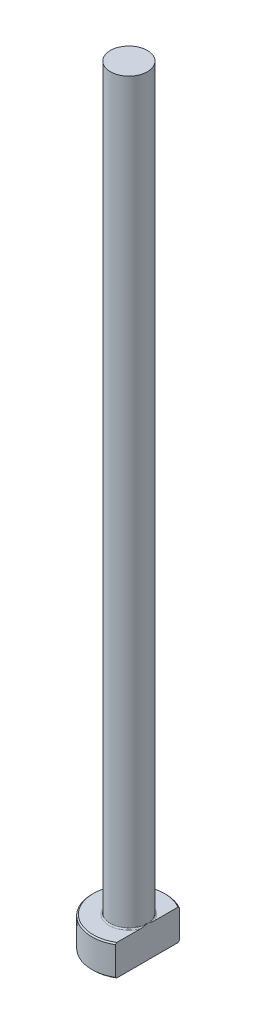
ISO-10303-21;
HEADER;
FILE_DESCRIPTION(('STEP AP214'),'2;1');
FILE_NAME('part.step','',(''),(''),'','','');
FILE_SCHEMA(('AUTOMOTIVE_DESIGN { 1 0 10303 214 1 1 1 1 }'));
ENDSEC;
DATA;
#1=APPLICATION_CONTEXT('core data for automotive mechanical design processes');
#2=APPLICATION_PROTOCOL_DEFINITION('international standard','automotive_design',2000,#1);
#3=PRODUCT_CONTEXT('',#1,'mechanical');
#4=PRODUCT('Part','Part','',(#3));
#5=PRODUCT_RELATED_PRODUCT_CATEGORY('part','',(#4));
#6=PRODUCT_DEFINITION_FORMATION('','',#4);
#7=PRODUCT_DEFINITION_CONTEXT('part definition',#1,'design');
#8=PRODUCT_DEFINITION('design','',#6,#7);
#9=PRODUCT_DEFINITION_SHAPE('','',#8);
#10=(LENGTH_UNIT() NAMED_UNIT(*) SI_UNIT(.MILLI.,.METRE.));
#11=(NAMED_UNIT(*) PLANE_ANGLE_UNIT() SI_UNIT($,.RADIAN.));
#12=(NAMED_UNIT(*) SI_UNIT($,.STERADIAN.) SOLID_ANGLE_UNIT());
#13=UNCERTAINTY_MEASURE_WITH_UNIT(LENGTH_MEASURE(1.E-05),#10,'distance_accuracy_value','');
#14=(GEOMETRIC_REPRESENTATION_CONTEXT(3) GLOBAL_UNCERTAINTY_ASSIGNED_CONTEXT((#13)) GLOBAL_UNIT_ASSIGNED_CONTEXT((#10,
#11,#12)) REPRESENTATION_CONTEXT('',''));
#15=CARTESIAN_POINT('',(0.,0.,0.));
#16=DIRECTION('',(0.,0.,1.));
#17=DIRECTION('',(1.,0.,0.));
#18=AXIS2_PLACEMENT_3D('',#15,#16,#17);
#19=CARTESIAN_POINT('',(0.,0.,0.));
#20=DIRECTION('',(0.,-1.,0.));
#21=DIRECTION('',(0.,0.,-1.));
#22=AXIS2_PLACEMENT_3D('',#19,#20,#21);
#23=PLANE('',#22);
#24=CARTESIAN_POINT('',(0.,0.,0.));
#25=DIRECTION('',(0.,-1.,0.));
#26=DIRECTION('',(0.,0.,-1.));
#27=AXIS2_PLACEMENT_3D('',#24,#25,#26);
#28=CIRCLE('',#27,5.79999999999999);
#29=CARTESIAN_POINT('',(2.99999999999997,0.,4.96386945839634));
#30=VERTEX_POINT('',#29);
#31=CARTESIAN_POINT('',(2.99999999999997,0.,-4.96386945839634));
#32=VERTEX_POINT('',#31);
#33=EDGE_CURVE('E98',#30,#32,#28,.T.);
#34=ORIENTED_EDGE('',*,*,#33,.T.);
#35=DIRECTION('',(0.,0.,1.));
#36=VECTOR('',#35,1.);
#37=CARTESIAN_POINT('',(2.99999999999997,0.,-5.19615242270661));
#38=LINE('',#37,#36);
#39=EDGE_CURVE('E83',#32,#30,#38,.T.);
#40=ORIENTED_EDGE('',*,*,#39,.T.);
#41=EDGE_LOOP('',(#34,#40));
#42=FACE_BOUND('',#41,.T.);
#43=ADVANCED_FACE('F32',(#42),#23,.T.);
#44=CARTESIAN_POINT('',(0.,259.958771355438,0.));
#45=DIRECTION('',(0.,1.,0.));
#46=DIRECTION('',(0.,0.,1.));
#47=AXIS2_PLACEMENT_3D('',#44,#45,#46);
#48=CYLINDRICAL_SURFACE('',#47,5.99999999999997);
#49=CARTESIAN_POINT('',(0.,4.79999999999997,0.));
#50=DIRECTION('',(0.,1.,0.));
#51=DIRECTION('',(0.,0.,1.));
#52=AXIS2_PLACEMENT_3D('',#49,#50,#51);
#53=CIRCLE('',#52,5.99999999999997);
#54=CARTESIAN_POINT('',(2.99999999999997,4.79999999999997,5.19615242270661));
#55=VERTEX_POINT('',#54);
#56=CARTESIAN_POINT('',(2.99999999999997,4.79999999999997,-5.19615242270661));
#57=VERTEX_POINT('',#56);
#58=EDGE_CURVE('E104',#55,#57,#53,.F.);
#59=ORIENTED_EDGE('',*,*,#58,.T.);
#60=DIRECTION('',(0.,-1.,0.));
#61=VECTOR('',#60,1.);
#62=CARTESIAN_POINT('',(2.99999999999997,125.,-5.19615242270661));
#63=LINE('',#62,#61);
#64=CARTESIAN_POINT('',(2.99999999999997,0.199999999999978,-5.19615242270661));
#65=VERTEX_POINT('',#64);
#66=EDGE_CURVE('E183',#57,#65,#63,.T.);
#67=ORIENTED_EDGE('',*,*,#66,.T.);
#68=CARTESIAN_POINT('',(0.,0.199999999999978,0.));
#69=DIRECTION('',(0.,-1.,0.));
#70=DIRECTION('',(0.,0.,-1.));
#71=AXIS2_PLACEMENT_3D('',#68,#69,#70);
#72=CIRCLE('',#71,5.99999999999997);
#73=CARTESIAN_POINT('',(2.99999999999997,0.199999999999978,5.19615242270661));
#74=VERTEX_POINT('',#73);
#75=EDGE_CURVE('E100',#65,#74,#72,.F.);
#76=ORIENTED_EDGE('',*,*,#75,.T.);
#77=DIRECTION('',(0.,-1.,0.));
#78=VECTOR('',#77,1.);
#79=CARTESIAN_POINT('',(2.99999999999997,125.,5.19615242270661));
#80=LINE('',#79,#78);
#81=EDGE_CURVE('E93',#55,#74,#80,.T.);
#82=ORIENTED_EDGE('',*,*,#81,.F.);
#83=EDGE_LOOP('',(#59,#67,#76,#82));
#84=FACE_BOUND('',#83,.T.);
#85=ADVANCED_FACE('F158',(#84),#48,.T.);
#86=CARTESIAN_POINT('',(-5.99999999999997,5.,0.));
#87=DIRECTION('',(0.,1.,0.));
#88=DIRECTION('',(0.,0.,1.));
#89=AXIS2_PLACEMENT_3D('',#86,#87,#88);
#90=PLANE('',#89);
#91=CARTESIAN_POINT('',(0.,5.,0.));
#92=DIRECTION('',(0.,1.,0.));
#93=DIRECTION('',(0.,0.,1.));
#94=AXIS2_PLACEMENT_3D('',#91,#92,#93);
#95=CIRCLE('',#94,5.79999999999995);
#96=CARTESIAN_POINT('',(2.99999999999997,5.,-4.9638694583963));
#97=VERTEX_POINT('',#96);
#98=CARTESIAN_POINT('',(2.99999999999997,5.,4.9638694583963));
#99=VERTEX_POINT('',#98);
#100=EDGE_CURVE('E178',#97,#99,#95,.T.);
#101=ORIENTED_EDGE('',*,*,#100,.T.);
#102=DIRECTION('',(0.,0.,-1.));
#103=VECTOR('',#102,1.);
#104=CARTESIAN_POINT('',(2.99999999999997,5.,0.));
#105=LINE('',#104,#103);
#106=CARTESIAN_POINT('',(2.99999999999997,4.99999999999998,1.11355287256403));
#107=VERTEX_POINT('',#106);
#108=EDGE_CURVE('E57',#99,#107,#105,.T.);
#109=ORIENTED_EDGE('',*,*,#108,.T.);
#110=CARTESIAN_POINT('',(0.,5.,0.));
#111=DIRECTION('',(0.,1.,0.));
#112=DIRECTION('',(0.,0.,1.));
#113=AXIS2_PLACEMENT_3D('',#110,#111,#112);
#114=CIRCLE('',#113,3.19999999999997);
#115=CARTESIAN_POINT('',(2.99999999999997,4.99999999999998,-1.113552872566));
#116=VERTEX_POINT('',#115);
#117=EDGE_CURVE('E107',#107,#116,#114,.F.);
#118=ORIENTED_EDGE('',*,*,#117,.T.);
#119=EDGE_CURVE('E136',#116,#97,#105,.T.);
#120=ORIENTED_EDGE('',*,*,#119,.T.);
#121=EDGE_LOOP('',(#101,#109,#118,#120));
#122=FACE_BOUND('',#121,.T.);
#123=ADVANCED_FACE('F147',(#122),#90,.T.);
#124=CARTESIAN_POINT('',(0.,5.,0.));
#125=DIRECTION('',(0.,-1.,0.));
#126=DIRECTION('',(0.,0.,-1.));
#127=AXIS2_PLACEMENT_3D('',#124,#125,#126);
#128=CONICAL_SURFACE('',#127,5.79999999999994,0.785398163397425);
#129=ORIENTED_EDGE('',*,*,#58,.F.);
#130=CARTESIAN_POINT('',(2.99999999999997,-1.01993959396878,11.432889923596));
#131=CARTESIAN_POINT('',(2.99999999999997,-0.7694249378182,11.1738796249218));
#132=CARTESIAN_POINT('',(2.99999999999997,-0.519179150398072,10.9146084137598));
#133=CARTESIAN_POINT('',(2.99999999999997,-0.0193842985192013,10.3953890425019));
#134=CARTESIAN_POINT('',(2.99999999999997,0.230164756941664,10.1354408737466));
#135=CARTESIAN_POINT('',(2.99999999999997,0.728528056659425,9.61458602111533));
#136=CARTESIAN_POINT('',(2.99999999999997,0.977341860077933,9.35367891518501));
#137=CARTESIAN_POINT('',(2.99999999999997,1.47386965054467,8.8308227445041));
#138=CARTESIAN_POINT('',(2.99999999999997,1.7215836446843,8.56887368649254));
#139=CARTESIAN_POINT('',(2.99999999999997,2.21069282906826,8.04884148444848));
#140=CARTESIAN_POINT('',(2.99999999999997,2.45211594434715,7.79078462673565));
#141=CARTESIAN_POINT('',(2.99999999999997,2.93315589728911,7.27299342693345));
#142=CARTESIAN_POINT('',(2.99999999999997,3.17277274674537,7.01325909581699));
#143=CARTESIAN_POINT('',(2.99999999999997,3.64950020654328,6.4915999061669));
#144=CARTESIAN_POINT('',(2.99999999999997,3.88661134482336,6.22967553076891));
#145=CARTESIAN_POINT('',(2.99999999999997,4.35738571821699,5.70275148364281));
#146=CARTESIAN_POINT('',(2.99999999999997,4.5910490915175,5.43775193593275));
#147=CARTESIAN_POINT('',(2.99999999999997,4.96416348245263,5.00636825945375));
#148=CARTESIAN_POINT('',(2.99999999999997,5.10520133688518,4.84135845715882));
#149=CARTESIAN_POINT('',(2.99999999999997,5.38476673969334,4.50919282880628));
#150=CARTESIAN_POINT('',(2.99999999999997,5.52329404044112,4.3420367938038));
#151=CARTESIAN_POINT('',(2.99999999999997,5.79842961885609,4.00319933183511));
#152=CARTESIAN_POINT('',(2.99999999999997,5.93500216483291,3.83148875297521));
#153=CARTESIAN_POINT('',(2.99999999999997,6.20336281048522,3.48442112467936));
#154=CARTESIAN_POINT('',(2.99999999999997,6.33515205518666,3.30906496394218));
#155=CARTESIAN_POINT('',(2.99999999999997,6.59393382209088,2.9507080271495));
#156=CARTESIAN_POINT('',(2.99999999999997,6.72082315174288,2.76763161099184));
#157=CARTESIAN_POINT('',(2.99999999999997,6.90336321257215,2.48771743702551));
#158=CARTESIAN_POINT('',(2.99999999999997,6.96295431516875,2.39345390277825));
#159=CARTESIAN_POINT('',(2.99999999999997,7.07882720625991,2.20292146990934));
#160=CARTESIAN_POINT('',(2.99999999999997,7.13510937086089,2.10665280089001));
#161=CARTESIAN_POINT('',(2.99999999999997,7.24288059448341,1.91297779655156));
#162=CARTESIAN_POINT('',(2.99999999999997,7.29441986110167,1.81559978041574));
#163=CARTESIAN_POINT('',(2.99999999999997,7.39241237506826,1.61833215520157));
#164=CARTESIAN_POINT('',(2.99999999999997,7.43886469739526,1.51844209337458));
#165=CARTESIAN_POINT('',(2.99999999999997,7.56840030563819,1.21511948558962));
#166=CARTESIAN_POINT('',(2.99999999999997,7.64209011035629,1.00730397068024));
#167=CARTESIAN_POINT('',(2.99999999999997,7.72186700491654,0.695731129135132));
#168=CARTESIAN_POINT('',(2.99999999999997,7.74302901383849,0.595791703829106));
#169=CARTESIAN_POINT('',(2.99999999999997,7.77582528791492,0.394325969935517));
#170=CARTESIAN_POINT('',(2.99999999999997,7.78746040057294,0.29279980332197));
#171=CARTESIAN_POINT('',(2.99999999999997,7.80037895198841,0.0893987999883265));
#172=CARTESIAN_POINT('',(2.99999999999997,7.80169449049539,-0.0124739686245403));
#173=CARTESIAN_POINT('',(2.99999999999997,7.79396363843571,-0.215826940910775));
#174=CARTESIAN_POINT('',(2.99999999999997,7.78491639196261,-0.317307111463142));
#175=CARTESIAN_POINT('',(2.99999999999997,7.75721241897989,-0.518039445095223));
#176=CARTESIAN_POINT('',(2.99999999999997,7.73863812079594,-0.61730321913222));
#177=CARTESIAN_POINT('',(2.99999999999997,7.69303955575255,-0.813850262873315));
#178=CARTESIAN_POINT('',(2.99999999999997,7.66601427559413,-0.911133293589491));
#179=CARTESIAN_POINT('',(2.99999999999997,7.60464499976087,-1.10394843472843));
#180=CARTESIAN_POINT('',(2.99999999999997,7.57025976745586,-1.19946724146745));
#181=CARTESIAN_POINT('',(2.99999999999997,7.49555762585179,-1.38810736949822));
#182=CARTESIAN_POINT('',(2.99999999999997,7.45524192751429,-1.48122917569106));
#183=CARTESIAN_POINT('',(2.99999999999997,7.36961028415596,-1.66561491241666));
#184=CARTESIAN_POINT('',(2.99999999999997,7.32427350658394,-1.75686908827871));
#185=CARTESIAN_POINT('',(2.99999999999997,7.22966073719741,-1.93732130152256));
#186=CARTESIAN_POINT('',(2.99999999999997,7.18038388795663,-2.02651888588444));
#187=CARTESIAN_POINT('',(2.99999999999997,7.02771106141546,-2.29153460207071));
#188=CARTESIAN_POINT('',(2.99999999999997,6.91955486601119,-2.46460625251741));
#189=CARTESIAN_POINT('',(2.99999999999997,6.69440299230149,-2.80577028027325));
#190=CARTESIAN_POINT('',(2.99999999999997,6.57737415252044,-2.97384034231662));
#191=CARTESIAN_POINT('',(2.99999999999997,6.33748949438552,-3.30561771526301));
#192=CARTESIAN_POINT('',(2.99999999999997,6.2146366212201,-3.46932716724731));
#193=CARTESIAN_POINT('',(2.99999999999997,5.96308085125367,-3.79561670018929));
#194=CARTESIAN_POINT('',(2.99999999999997,5.83432224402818,-3.95815356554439));
#195=CARTESIAN_POINT('',(2.99999999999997,5.57361365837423,-4.28066737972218));
#196=CARTESIAN_POINT('',(2.99999999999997,5.44166333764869,-4.44064405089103));
#197=CARTESIAN_POINT('',(2.99999999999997,5.1756844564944,-4.75819552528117));
#198=CARTESIAN_POINT('',(2.99999999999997,5.04166171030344,-4.91577521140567));
#199=CARTESIAN_POINT('',(2.99999999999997,4.77176230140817,-5.22934053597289));
#200=CARTESIAN_POINT('',(2.99999999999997,4.63588560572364,-5.38532614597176));
#201=CARTESIAN_POINT('',(2.99999999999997,4.27256222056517,-5.79849838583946));
#202=CARTESIAN_POINT('',(2.99999999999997,4.04384014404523,-6.05456265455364));
#203=CARTESIAN_POINT('',(2.99999999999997,3.5836002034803,-6.56417037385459));
#204=CARTESIAN_POINT('',(2.99999999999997,3.35208226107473,-6.81771375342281));
#205=CARTESIAN_POINT('',(2.99999999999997,2.88678846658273,-7.32315936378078));
#206=CARTESIAN_POINT('',(2.99999999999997,2.65301069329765,-7.5750598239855));
#207=CARTESIAN_POINT('',(2.99999999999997,2.18392232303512,-8.07742926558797));
#208=CARTESIAN_POINT('',(2.99999999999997,1.94861172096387,-8.32789824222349));
#209=CARTESIAN_POINT('',(2.99999999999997,1.48651581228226,-8.8174394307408));
#210=CARTESIAN_POINT('',(2.99999999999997,1.25977806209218,-9.05655656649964));
#211=CARTESIAN_POINT('',(2.99999999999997,0.805439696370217,-9.533971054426));
#212=CARTESIAN_POINT('',(2.99999999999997,0.57783907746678,-9.77226840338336));
#213=CARTESIAN_POINT('',(2.99999999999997,0.122198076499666,-10.2479325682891));
#214=CARTESIAN_POINT('',(2.99999999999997,-0.105841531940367,-10.4853001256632));
#215=CARTESIAN_POINT('',(2.99999999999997,-0.562491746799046,-10.9594816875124));
#216=CARTESIAN_POINT('',(2.99999999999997,-0.791102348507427,-11.1962956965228));
#217=CARTESIAN_POINT('',(2.99999999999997,-1.01993959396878,-11.432889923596));
#218=B_SPLINE_CURVE_WITH_KNOTS('',3,(#130,#131,#132,#133,#134,#135,#136,#137,#138,#139,#140,
#141,#142,#143,#144,#145,#146,#147,#148,#149,#150,#151,#152,#153,#154,#155,#156,#157,#158,#159,
#160,#161,#162,#163,#164,#165,#166,#167,#168,#169,#170,#171,#172,#173,#174,#175,#176,#177,#178,
#179,#180,#181,#182,#183,#184,#185,#186,#187,#188,#189,#190,#191,#192,#193,#194,#195,#196,#197,
#198,#199,#200,#201,#202,#203,#204,#205,#206,#207,#208,#209,#210,#211,#212,#213,#214,#215,#216,
#217),.UNSPECIFIED.,.F.,.F.,(4,2,2,2,2,2,2,2,2,2,2,2,2,2,2,2,2,2,2,2,2,2,2,2,2,2,2,2,2,2,2,2,2,
2,2,2,2,2,2,2,2,2,2,4),(0.,1.0810166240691,2.16204714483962,3.24363027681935,4.32520642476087,
5.38534462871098,6.44547590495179,7.50537917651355,8.56523985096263,9.21643479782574,
9.8676936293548,10.5258323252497,11.1838124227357,11.8517813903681,12.1862877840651,
12.520756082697,12.8511332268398,13.1815703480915,13.8399161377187,14.1460077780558,
14.4520721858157,14.7571841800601,15.0623213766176,15.364861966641,15.6674388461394,
15.9717575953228,16.2760142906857,16.581584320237,16.8872210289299,17.4990577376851,
18.1133060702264,18.7272470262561,19.3492675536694,19.9713550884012,20.5919343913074,
21.2125247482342,22.2425132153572,23.2725306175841,24.3035181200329,25.3345090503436,
26.32308273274,27.3116602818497,28.2991352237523,29.2866020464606),.UNSPECIFIED.);
#219=EDGE_CURVE('E135',#55,#99,#218,.T.);
#220=ORIENTED_EDGE('',*,*,#219,.T.);
#221=ORIENTED_EDGE('',*,*,#100,.F.);
#222=EDGE_CURVE('E127',#97,#57,#218,.T.);
#223=ORIENTED_EDGE('',*,*,#222,.T.);
#224=EDGE_LOOP('',(#129,#220,#221,#223));
#225=FACE_BOUND('',#224,.T.);
#226=ADVANCED_FACE('F143',(#225),#128,.T.);
#227=CARTESIAN_POINT('',(0.,0.199999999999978,0.));
#228=DIRECTION('',(0.,1.,0.));
#229=DIRECTION('',(0.,0.,1.));
#230=AXIS2_PLACEMENT_3D('',#227,#228,#229);
#231=CONICAL_SURFACE('',#230,5.99999999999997,0.785398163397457);
#232=ORIENTED_EDGE('',*,*,#75,.F.);
#233=CARTESIAN_POINT('',(2.99999999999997,6.01993959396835,-11.432889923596));
#234=CARTESIAN_POINT('',(2.99999999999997,5.7694249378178,-11.1738796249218));
#235=CARTESIAN_POINT('',(2.99999999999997,5.5191791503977,-10.9146084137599));
#236=CARTESIAN_POINT('',(2.99999999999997,5.01938429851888,-10.395389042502));
#237=CARTESIAN_POINT('',(2.99999999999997,4.76983524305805,-10.1354408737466));
#238=CARTESIAN_POINT('',(2.99999999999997,4.27147194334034,-9.61458602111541));
#239=CARTESIAN_POINT('',(2.99999999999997,4.02265813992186,-9.35367891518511));
#240=CARTESIAN_POINT('',(2.99999999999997,3.52613034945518,-8.83082274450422));
#241=CARTESIAN_POINT('',(2.99999999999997,3.27841635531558,-8.56887368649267));
#242=CARTESIAN_POINT('',(2.99999999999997,2.78930717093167,-8.04884148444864));
#243=CARTESIAN_POINT('',(2.99999999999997,2.5478840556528,-7.79078462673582));
#244=CARTESIAN_POINT('',(2.99999999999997,2.0668441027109,-7.27299342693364));
#245=CARTESIAN_POINT('',(2.99999999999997,1.82722725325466,-7.0132590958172));
#246=CARTESIAN_POINT('',(2.99999999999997,1.3504997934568,-6.49159990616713));
#247=CARTESIAN_POINT('',(2.99999999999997,1.11338865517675,-6.22967553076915));
#248=CARTESIAN_POINT('',(2.99999999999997,0.642614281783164,-5.70275148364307));
#249=CARTESIAN_POINT('',(2.99999999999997,0.408950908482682,-5.43775193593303));
#250=CARTESIAN_POINT('',(2.99999999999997,0.0358365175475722,-5.00636825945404));
#251=CARTESIAN_POINT('',(2.99999999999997,-0.105201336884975,-4.8413584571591));
#252=CARTESIAN_POINT('',(2.99999999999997,-0.384766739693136,-4.50919282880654));
#253=CARTESIAN_POINT('',(2.99999999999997,-0.523294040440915,-4.34203679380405));
#254=CARTESIAN_POINT('',(2.99999999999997,-0.798429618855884,-4.00319933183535));
#255=CARTESIAN_POINT('',(2.99999999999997,-0.93500216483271,-3.83148875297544));
#256=CARTESIAN_POINT('',(2.99999999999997,-1.20336281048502,-3.48442112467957));
#257=CARTESIAN_POINT('',(2.99999999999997,-1.33515205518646,-3.30906496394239));
#258=CARTESIAN_POINT('',(2.99999999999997,-1.59393382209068,-2.9507080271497));
#259=CARTESIAN_POINT('',(2.99999999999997,-1.72082315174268,-2.76763161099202));
#260=CARTESIAN_POINT('',(2.99999999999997,-1.90336321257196,-2.48771743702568));
#261=CARTESIAN_POINT('',(2.99999999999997,-1.96295431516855,-2.39345390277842));
#262=CARTESIAN_POINT('',(2.99999999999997,-2.07882720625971,-2.20292146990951));
#263=CARTESIAN_POINT('',(2.99999999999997,-2.13510937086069,-2.10665280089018));
#264=CARTESIAN_POINT('',(2.99999999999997,-2.24288059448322,-1.91297779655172));
#265=CARTESIAN_POINT('',(2.99999999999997,-2.29441986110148,-1.8155997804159));
#266=CARTESIAN_POINT('',(2.99999999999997,-2.39241237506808,-1.61833215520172));
#267=CARTESIAN_POINT('',(2.99999999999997,-2.43886469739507,-1.51844209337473));
#268=CARTESIAN_POINT('',(2.99999999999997,-2.56840030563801,-1.21511948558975));
#269=CARTESIAN_POINT('',(2.99999999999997,-2.64209011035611,-1.00730397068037));
#270=CARTESIAN_POINT('',(2.99999999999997,-2.72186700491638,-0.695731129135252));
#271=CARTESIAN_POINT('',(2.99999999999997,-2.74302901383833,-0.595791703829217));
#272=CARTESIAN_POINT('',(2.99999999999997,-2.77582528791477,-0.394325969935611));
#273=CARTESIAN_POINT('',(2.99999999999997,-2.78746040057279,-0.292799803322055));
#274=CARTESIAN_POINT('',(2.99999999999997,-2.80037895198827,-0.0893987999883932));
#275=CARTESIAN_POINT('',(2.99999999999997,-2.80169449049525,0.0124739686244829));
#276=CARTESIAN_POINT('',(2.99999999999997,-2.79396363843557,0.215826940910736));
#277=CARTESIAN_POINT('',(2.99999999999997,-2.78491639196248,0.317307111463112));
#278=CARTESIAN_POINT('',(2.99999999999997,-2.75721241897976,0.518039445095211));
#279=CARTESIAN_POINT('',(2.99999999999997,-2.7386381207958,0.617303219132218));
#280=CARTESIAN_POINT('',(2.99999999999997,-2.69303955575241,0.813850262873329));
#281=CARTESIAN_POINT('',(2.99999999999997,-2.66601427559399,0.911133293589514));
#282=CARTESIAN_POINT('',(2.99999999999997,-2.60464499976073,1.10394843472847));
#283=CARTESIAN_POINT('',(2.99999999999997,-2.57025976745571,1.1994672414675));
#284=CARTESIAN_POINT('',(2.99999999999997,-2.49555762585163,1.38810736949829));
#285=CARTESIAN_POINT('',(2.99999999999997,-2.45524192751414,1.48122917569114));
#286=CARTESIAN_POINT('',(2.99999999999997,-2.36961028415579,1.66561491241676));
#287=CARTESIAN_POINT('',(2.99999999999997,-2.32427350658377,1.75686908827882));
#288=CARTESIAN_POINT('',(2.99999999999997,-2.22966073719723,1.9373213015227));
#289=CARTESIAN_POINT('',(2.99999999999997,-2.18038388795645,2.02651888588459));
#290=CARTESIAN_POINT('',(2.99999999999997,-2.02771106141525,2.29153460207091));
#291=CARTESIAN_POINT('',(2.99999999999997,-1.91955486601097,2.46460625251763));
#292=CARTESIAN_POINT('',(2.99999999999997,-1.69440299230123,2.80577028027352));
#293=CARTESIAN_POINT('',(2.99999999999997,-1.57737415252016,2.97384034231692));
#294=CARTESIAN_POINT('',(2.99999999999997,-1.33748949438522,3.30561771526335));
#295=CARTESIAN_POINT('',(2.99999999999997,-1.21463662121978,3.46932716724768));
#296=CARTESIAN_POINT('',(2.99999999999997,-0.963080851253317,3.79561670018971));
#297=CARTESIAN_POINT('',(2.99999999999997,-0.834322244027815,3.95815356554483));
#298=CARTESIAN_POINT('',(2.99999999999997,-0.573613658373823,4.28066737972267));
#299=CARTESIAN_POINT('',(2.99999999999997,-0.441663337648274,4.44064405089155));
#300=CARTESIAN_POINT('',(2.99999999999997,-0.17568445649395,4.75819552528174));
#301=CARTESIAN_POINT('',(2.99999999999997,-0.0416617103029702,4.91577521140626));
#302=CARTESIAN_POINT('',(2.99999999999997,0.228237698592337,5.22934053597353));
#303=CARTESIAN_POINT('',(2.99999999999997,0.364114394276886,5.38532614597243));
#304=CARTESIAN_POINT('',(2.99999999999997,0.727437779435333,5.79849838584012));
#305=CARTESIAN_POINT('',(2.99999999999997,0.956159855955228,6.05456265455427));
#306=CARTESIAN_POINT('',(2.99999999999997,1.41639979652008,6.56417037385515));
#307=CARTESIAN_POINT('',(2.99999999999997,1.64791773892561,6.81771375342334));
#308=CARTESIAN_POINT('',(2.99999999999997,2.11321153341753,7.32315936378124));
#309=CARTESIAN_POINT('',(2.99999999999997,2.34698930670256,7.57505982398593));
#310=CARTESIAN_POINT('',(2.99999999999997,2.816077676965,8.07742926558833));
#311=CARTESIAN_POINT('',(2.99999999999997,3.05138827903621,8.32789824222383));
#312=CARTESIAN_POINT('',(2.99999999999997,3.51348418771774,8.81743943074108));
#313=CARTESIAN_POINT('',(2.99999999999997,3.74022193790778,9.05655656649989));
#314=CARTESIAN_POINT('',(2.99999999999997,4.19456030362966,9.5339710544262));
#315=CARTESIAN_POINT('',(2.99999999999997,4.42216092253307,9.77226840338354));
#316=CARTESIAN_POINT('',(2.99999999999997,4.8778019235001,10.2479325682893));
#317=CARTESIAN_POINT('',(2.99999999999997,5.1058415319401,10.4853001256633));
#318=CARTESIAN_POINT('',(2.99999999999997,5.5624917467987,10.9594816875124));
#319=CARTESIAN_POINT('',(2.99999999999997,5.79110234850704,11.1962956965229));
#320=CARTESIAN_POINT('',(2.99999999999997,6.01993959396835,11.432889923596));
#321=B_SPLINE_CURVE_WITH_KNOTS('',3,(#233,#234,#235,#236,#237,#238,#239,#240,#241,#242,#243,
#244,#245,#246,#247,#248,#249,#250,#251,#252,#253,#254,#255,#256,#257,#258,#259,#260,#261,#262,
#263,#264,#265,#266,#267,#268,#269,#270,#271,#272,#273,#274,#275,#276,#277,#278,#279,#280,#281,
#282,#283,#284,#285,#286,#287,#288,#289,#290,#291,#292,#293,#294,#295,#296,#297,#298,#299,#300,
#301,#302,#303,#304,#305,#306,#307,#308,#309,#310,#311,#312,#313,#314,#315,#316,#317,#318,#319,
#320),.UNSPECIFIED.,.F.,.F.,(4,2,2,2,2,2,2,2,2,2,2,2,2,2,2,2,2,2,2,2,2,2,2,2,2,2,2,2,2,2,2,2,2,
2,2,2,2,2,2,2,2,2,2,4),(0.,1.08101662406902,2.16204714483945,3.2436302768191,4.32520642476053,
5.38534462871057,6.4454759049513,7.50537917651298,8.56523985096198,9.21643479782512,
9.8676936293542,10.5258323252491,11.1838124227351,11.8517813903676,12.1862877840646,
12.5207560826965,12.8511332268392,13.181570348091,13.8399161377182,14.1460077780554,
14.4520721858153,14.7571841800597,15.0623213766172,15.3648619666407,15.667438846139,
15.9717575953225,16.2760142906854,16.5815843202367,16.8872210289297,17.499057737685,
18.1133060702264,18.7272470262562,19.3492675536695,19.9713550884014,20.5919343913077,
21.2125247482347,22.2425132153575,23.2725306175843,24.3035181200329,25.3345090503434,
26.3230827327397,27.3116602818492,28.2991352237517,29.2866020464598),.UNSPECIFIED.);
#322=EDGE_CURVE('E86',#65,#32,#321,.T.);
#323=ORIENTED_EDGE('',*,*,#322,.T.);
#324=ORIENTED_EDGE('',*,*,#33,.F.);
#325=EDGE_CURVE('E89',#30,#74,#321,.T.);
#326=ORIENTED_EDGE('',*,*,#325,.T.);
#327=EDGE_LOOP('',(#232,#323,#324,#326));
#328=FACE_BOUND('',#327,.T.);
#329=ADVANCED_FACE('F97',(#328),#231,.T.);
#330=CARTESIAN_POINT('',(0.,5.19999999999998,0.));
#331=DIRECTION('',(0.,1.,0.));
#332=DIRECTION('',(0.,0.,1.));
#333=AXIS2_PLACEMENT_3D('',#330,#331,#332);
#334=TOROIDAL_SURFACE('',#333,3.19999999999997,0.2);
#335=CARTESIAN_POINT('',(2.99999999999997,5.19999999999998,0.));
#336=CARTESIAN_POINT('',(2.99999999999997,5.20000054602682,-8.25589702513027E-09));
#337=CARTESIAN_POINT('',(2.99999999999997,5.20000108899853,-2.22623702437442E-07));
#338=CARTESIAN_POINT('',(2.99999999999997,5.20000210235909,-8.13181300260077E-07));
#339=CARTESIAN_POINT('',(2.99999999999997,5.20000256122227,-1.20262206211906E-06));
#340=CARTESIAN_POINT('',(2.99999999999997,5.20000351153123,-2.13233189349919E-06));
#341=CARTESIAN_POINT('',(2.99999999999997,5.2000039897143,-2.68711073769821E-06));
#342=CARTESIAN_POINT('',(2.99999999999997,5.20000484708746,-3.83722986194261E-06));
#343=CARTESIAN_POINT('',(2.99999999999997,5.20000522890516,-4.43075968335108E-06));
#344=CARTESIAN_POINT('',(2.99999999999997,5.20000663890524,-6.71805399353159E-06));
#345=CARTESIAN_POINT('',(2.99999999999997,5.20000758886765,-8.46267320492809E-06));
#346=CARTESIAN_POINT('',(2.99999999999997,5.20000915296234,-1.19195937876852E-05));
#347=CARTESIAN_POINT('',(2.99999999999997,5.20000978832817,-1.36226966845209E-05));
#348=CARTESIAN_POINT('',(2.99999999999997,5.20001243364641,-2.07785327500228E-05));
#349=CARTESIAN_POINT('',(2.99999999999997,5.20001439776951,-2.62512686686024E-05));
#350=CARTESIAN_POINT('',(2.99999999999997,5.20001730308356,-3.65971251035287E-05));
#351=CARTESIAN_POINT('',(2.99999999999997,5.20001835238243,-4.14397201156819E-05));
#352=CARTESIAN_POINT('',(2.99999999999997,5.20002589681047,-7.68826107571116E-05));
#353=CARTESIAN_POINT('',(2.99999999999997,5.20003169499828,-0.000107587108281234));
#354=CARTESIAN_POINT('',(2.99999999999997,5.20005649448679,-0.000225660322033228));
#355=CARTESIAN_POINT('',(2.99999999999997,5.2000799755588,-0.000312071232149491));
#356=CARTESIAN_POINT('',(2.99999999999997,5.2001671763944,-0.000638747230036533));
#357=CARTESIAN_POINT('',(2.99999999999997,5.20022823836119,-0.000879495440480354));
#358=CARTESIAN_POINT('',(2.99999999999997,5.20046253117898,-0.00179757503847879));
#359=CARTESIAN_POINT('',(2.99999999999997,5.20063826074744,-0.00247448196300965));
#360=CARTESIAN_POINT('',(2.99999999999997,5.20145771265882,-0.00563611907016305));
#361=CARTESIAN_POINT('',(2.99999999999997,5.20209802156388,-0.00812138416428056));
#362=CARTESIAN_POINT('',(2.99999999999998,5.207470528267,-0.0289666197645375));
#363=CARTESIAN_POINT('',(2.99999999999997,5.2122144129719,-0.0473249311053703));
#364=CARTESIAN_POINT('',(2.99999999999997,5.2215041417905,-0.0833908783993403));
#365=CARTESIAN_POINT('',(2.99999999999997,5.22605099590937,-0.101098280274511));
#366=CARTESIAN_POINT('',(2.99999999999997,5.24071513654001,-0.158441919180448));
#367=CARTESIAN_POINT('',(2.99999999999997,5.25076238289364,-0.198096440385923));
#368=CARTESIAN_POINT('',(2.99999999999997,5.26735876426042,-0.264903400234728));
#369=CARTESIAN_POINT('',(2.99999999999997,5.27400650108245,-0.292031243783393));
#370=CARTESIAN_POINT('',(2.99999999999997,5.28691139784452,-0.345693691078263));
#371=CARTESIAN_POINT('',(2.99999999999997,5.29317409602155,-0.372226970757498));
#372=CARTESIAN_POINT('',(2.99999999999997,5.31359314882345,-0.460847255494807));
#373=CARTESIAN_POINT('',(2.99999999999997,5.3271194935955,-0.52308420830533));
#374=CARTESIAN_POINT('',(2.99999999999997,5.35185224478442,-0.648627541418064));
#375=CARTESIAN_POINT('',(2.99999999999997,5.36303576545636,-0.711938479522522));
#376=CARTESIAN_POINT('',(2.99999999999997,5.382697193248,-0.845442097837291));
#377=CARTESIAN_POINT('',(2.99999999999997,5.39079783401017,-0.915695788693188));
#378=CARTESIAN_POINT('',(2.99999999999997,5.39788104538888,-1.02128246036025));
#379=CARTESIAN_POINT('',(2.99999999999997,5.399399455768,-1.05644278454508));
#380=CARTESIAN_POINT('',(2.99999999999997,5.40031405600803,-1.12678521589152));
#381=CARTESIAN_POINT('',(2.99999999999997,5.39971158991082,-1.16196729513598));
#382=CARTESIAN_POINT('',(2.99999999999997,5.39660553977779,-1.21713951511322));
#383=CARTESIAN_POINT('',(2.99999999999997,5.39502683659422,-1.23718181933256));
#384=CARTESIAN_POINT('',(2.99999999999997,5.39080008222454,-1.27717351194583));
#385=CARTESIAN_POINT('',(2.99999999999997,5.38815120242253,-1.29712281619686));
#386=CARTESIAN_POINT('',(2.99999999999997,5.38160570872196,-1.33655702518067));
#387=CARTESIAN_POINT('',(2.99999999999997,5.37772556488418,-1.35604460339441));
#388=CARTESIAN_POINT('',(2.99999999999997,5.36841119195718,-1.39463554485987));
#389=CARTESIAN_POINT('',(2.99999999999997,5.36297874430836,-1.41373932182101));
#390=CARTESIAN_POINT('',(2.99999999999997,5.3500393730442,-1.45151809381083));
#391=CARTESIAN_POINT('',(2.99999999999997,5.34250654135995,-1.47018435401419));
#392=CARTESIAN_POINT('',(2.99999999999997,5.32469433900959,-1.50617232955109));
#393=CARTESIAN_POINT('',(2.99999999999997,5.31442814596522,-1.52349999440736));
#394=CARTESIAN_POINT('',(2.99999999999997,5.29768486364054,-1.5453003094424));
#395=CARTESIAN_POINT('',(2.99999999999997,5.29285641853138,-1.551032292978));
#396=CARTESIAN_POINT('',(2.99999999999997,5.28257691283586,-1.56192749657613));
#397=CARTESIAN_POINT('',(2.99999999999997,5.27712536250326,-1.56709026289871));
#398=CARTESIAN_POINT('',(2.99999999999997,5.26548354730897,-1.57666725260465));
#399=CARTESIAN_POINT('',(2.99999999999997,5.25928560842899,-1.58107232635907));
#400=CARTESIAN_POINT('',(2.99999999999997,5.24620912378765,-1.5887219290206));
#401=CARTESIAN_POINT('',(2.99999999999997,5.23933242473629,-1.59196950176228));
#402=CARTESIAN_POINT('',(2.99999999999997,5.22702406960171,-1.5962468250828));
#403=CARTESIAN_POINT('',(2.99999999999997,5.2217197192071,-1.59764171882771));
#404=CARTESIAN_POINT('',(2.99999999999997,5.2109516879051,-1.59951721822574));
#405=CARTESIAN_POINT('',(2.99999999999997,5.20548813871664,-1.59999855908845));
#406=CARTESIAN_POINT('',(2.99999999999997,5.19455397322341,-1.60000143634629));
#407=CARTESIAN_POINT('',(2.99999999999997,5.18908335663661,-1.59952177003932));
#408=CARTESIAN_POINT('',(2.99999999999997,5.17830149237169,-1.59764696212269));
#409=CARTESIAN_POINT('',(2.99999999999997,5.17299036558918,-1.59625114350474));
#410=CARTESIAN_POINT('',(2.99999999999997,5.16137413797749,-1.5922159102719));
#411=CARTESIAN_POINT('',(2.99999999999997,5.15514663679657,-1.58935479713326));
#412=CARTESIAN_POINT('',(2.99999999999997,5.14323789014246,-1.58266473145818));
#413=CARTESIAN_POINT('',(2.99999999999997,5.13755768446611,-1.57883398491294));
#414=CARTESIAN_POINT('',(2.99999999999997,5.12388989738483,-1.5682309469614));
#415=CARTESIAN_POINT('',(2.99999999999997,5.11627920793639,-1.56097697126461));
#416=CARTESIAN_POINT('',(2.99999999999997,5.10222993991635,-1.54541986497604));
#417=CARTESIAN_POINT('',(2.99999999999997,5.09579438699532,-1.53711411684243));
#418=CARTESIAN_POINT('',(2.99999999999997,5.07874447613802,-1.51234359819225));
#419=CARTESIAN_POINT('',(2.99999999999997,5.06934681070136,-1.49505024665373));
#420=CARTESIAN_POINT('',(2.99999999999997,5.05300413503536,-1.45936637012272));
#421=CARTESIAN_POINT('',(2.99999999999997,5.04606563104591,-1.440973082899));
#422=CARTESIAN_POINT('',(2.99999999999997,5.03343712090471,-1.40170303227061));
#423=CARTESIAN_POINT('',(2.99999999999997,5.02794514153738,-1.38076360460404));
#424=CARTESIAN_POINT('',(2.99999999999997,5.01869119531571,-1.33849708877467));
#425=CARTESIAN_POINT('',(2.99999999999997,5.01493126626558,-1.31716957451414));
#426=CARTESIAN_POINT('',(2.99999999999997,5.00879575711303,-1.27427301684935));
#427=CARTESIAN_POINT('',(2.99999999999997,5.00642327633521,-1.25270354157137));
#428=CARTESIAN_POINT('',(2.99999999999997,5.00283272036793,-1.20948719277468));
#429=CARTESIAN_POINT('',(2.99999999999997,5.00161392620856,-1.18784037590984));
#430=CARTESIAN_POINT('',(2.99999999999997,4.99921193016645,-1.11739576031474));
#431=CARTESIAN_POINT('',(2.99999999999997,4.99998309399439,-1.06853061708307));
#432=CARTESIAN_POINT('',(2.99999999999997,5.00498456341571,-0.970964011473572));
#433=CARTESIAN_POINT('',(2.99999999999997,5.00921876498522,-0.922262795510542));
#434=CARTESIAN_POINT('',(2.99999999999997,5.02027934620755,-0.825023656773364));
#435=CARTESIAN_POINT('',(2.99999999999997,5.02711306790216,-0.776486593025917));
#436=CARTESIAN_POINT('',(2.99999999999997,5.04272509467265,-0.679720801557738));
#437=CARTESIAN_POINT('',(2.99999999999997,5.05150395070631,-0.631492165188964));
#438=CARTESIAN_POINT('',(2.99999999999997,5.07999589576,-0.487173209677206));
#439=CARTESIAN_POINT('',(2.99999999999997,5.10185558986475,-0.391514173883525));
#440=CARTESIAN_POINT('',(2.99999999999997,5.14819769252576,-0.200831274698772));
#441=CARTESIAN_POINT('',(2.99999999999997,5.17268119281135,-0.105807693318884));
#442=CARTESIAN_POINT('',(2.99999999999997,5.19722910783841,-0.0107318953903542));
#443=CARTESIAN_POINT('',(2.99999999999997,5.19724528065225,-0.0106692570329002));
#444=CARTESIAN_POINT('',(2.99999999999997,5.19781243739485,-0.00847232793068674));
#445=CARTESIAN_POINT('',(2.99999999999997,5.19836102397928,-0.00633759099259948));
#446=CARTESIAN_POINT('',(2.99999999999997,5.1991597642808,-0.00325873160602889));
#447=CARTESIAN_POINT('',(2.99999999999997,5.19940591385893,-0.00231386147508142));
#448=CARTESIAN_POINT('',(2.99999999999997,5.19972567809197,-0.00105818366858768));
#449=CARTESIAN_POINT('',(2.99999999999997,5.19980400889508,-0.000748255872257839));
#450=CARTESIAN_POINT('',(2.99999999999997,5.1999122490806,-0.000340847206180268));
#451=CARTESIAN_POINT('',(2.99999999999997,5.19993871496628,-0.000242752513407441));
#452=CARTESIAN_POINT('',(2.99999999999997,5.19996623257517,-0.000111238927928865));
#453=CARTESIAN_POINT('',(2.99999999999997,5.19997237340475,-7.89037769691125E-05));
#454=CARTESIAN_POINT('',(2.99999999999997,5.19998062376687,-4.17973012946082E-05));
#455=CARTESIAN_POINT('',(2.99999999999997,5.19998174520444,-3.68646325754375E-05));
#456=CARTESIAN_POINT('',(2.99999999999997,5.19998486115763,-2.6333709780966E-05));
#457=CARTESIAN_POINT('',(2.99999999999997,5.19998697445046,-2.0770778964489E-05));
#458=CARTESIAN_POINT('',(2.99999999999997,5.19998981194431,-1.35213137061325E-05));
#459=CARTESIAN_POINT('',(2.99999999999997,5.19999048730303,-1.18115060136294E-05));
#460=CARTESIAN_POINT('',(2.99999999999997,5.19999214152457,-8.34771962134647E-06));
#461=CARTESIAN_POINT('',(2.99999999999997,5.19999314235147,-6.60378870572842E-06));
#462=CARTESIAN_POINT('',(2.99999999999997,5.1999946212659,-4.32501646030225E-06));
#463=CARTESIAN_POINT('',(2.99999999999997,5.1999950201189,-3.73587510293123E-06));
#464=CARTESIAN_POINT('',(2.99999999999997,5.19999591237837,-2.59760768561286E-06));
#465=CARTESIAN_POINT('',(2.99999999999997,5.19999640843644,-2.05040430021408E-06));
#466=CARTESIAN_POINT('',(2.99999999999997,5.19999738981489,-1.1384674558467E-06));
#467=CARTESIAN_POINT('',(2.99999999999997,5.19999786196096,-7.58552551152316E-07));
#468=CARTESIAN_POINT('',(2.99999999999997,5.19999889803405,-1.92079005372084E-07));
#469=CARTESIAN_POINT('',(2.99999999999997,5.19999945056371,8.30744745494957E-09));
#470=CARTESIAN_POINT('',(2.99999999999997,5.19999999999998,0.));
#471=B_SPLINE_CURVE_WITH_KNOTS('',3,(#335,#336,#337,#338,#339,#340,#341,#342,#343,#344,#345,
#346,#347,#348,#349,#350,#351,#352,#353,#354,#355,#356,#357,#358,#359,#360,#361,#362,#363,#364,
#365,#366,#367,#368,#369,#370,#371,#372,#373,#374,#375,#376,#377,#378,#379,#380,#381,#382,#383,
#384,#385,#386,#387,#388,#389,#390,#391,#392,#393,#394,#395,#396,#397,#398,#399,#400,#401,#402,
#403,#404,#405,#406,#407,#408,#409,#410,#411,#412,#413,#414,#415,#416,#417,#418,#419,#420,#421,
#422,#423,#424,#425,#426,#427,#428,#429,#430,#431,#432,#433,#434,#435,#436,#437,#438,#439,#440,
#441,#442,#443,#444,#445,#446,#447,#448,#449,#450,#451,#452,#453,#454,#455,#456,#457,#458,#459,
#460,#461,#462,#463,#464,#465,#466,#467,#468,#469,#470),.UNSPECIFIED.,.T.,.F.,(4,2,2,2,2,2,2,2,
2,2,2,2,2,2,2,2,2,2,2,2,2,2,2,2,2,2,2,2,2,2,2,2,2,2,2,2,2,2,2,2,2,2,2,2,2,2,2,2,2,2,2,2,2,2,2,2,
2,2,2,2,2,2,2,2,2,2,2,4),(0.,1.65204701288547E-06,3.45848810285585E-06,5.64280272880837E-06,
7.75882449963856E-06,1.36969712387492E-05,1.9145444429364E-05,3.65603925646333E-05,
5.14083087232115E-05,0.000145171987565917,0.000413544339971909,0.00115890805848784,
0.00325667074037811,0.0109563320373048,0.067838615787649,0.122684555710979,0.245405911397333,
0.329196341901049,0.410983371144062,0.602016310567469,0.79483628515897,1.00673763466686,
1.11227258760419,1.21774067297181,1.27803175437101,1.33836960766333,1.39793215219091,
1.45742661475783,1.51769013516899,1.57766822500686,1.60011625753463,1.62258205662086,
1.64530254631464,1.66796284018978,1.68434680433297,1.70071757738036,1.71710885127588,
1.7335122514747,1.75395806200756,1.77444198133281,1.8058056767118,1.83724902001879,
1.89596356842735,1.95483231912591,2.01967230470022,2.08458838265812,2.14964892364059,
2.21466889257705,2.3610799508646,2.50765595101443,2.65464904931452,2.80168383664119,
3.09594779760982,3.39033467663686,3.39052875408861,3.3971415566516,3.40007033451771,
3.40102967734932,3.4013342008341,3.40143296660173,3.40144812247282,3.40146594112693,
3.40147145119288,3.401477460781,3.40147959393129,3.40148179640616,3.40148361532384,
3.40148527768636),.UNSPECIFIED.);
#472=CARTESIAN_POINT('',(2.99999999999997,5.19999999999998,0.));
#473=VERTEX_POINT('',#472);
#474=EDGE_CURVE('E11',#116,#473,#471,.T.);
#475=ORIENTED_EDGE('',*,*,#474,.F.);
#476=ORIENTED_EDGE('',*,*,#117,.F.);
#477=CARTESIAN_POINT('',(2.99999999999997,5.19999999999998,0.));
#478=CARTESIAN_POINT('',(2.99999999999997,5.19999945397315,8.25589702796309E-09));
#479=CARTESIAN_POINT('',(2.99999999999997,5.19999891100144,2.22623702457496E-07));
#480=CARTESIAN_POINT('',(2.99999999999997,5.19999789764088,8.13181300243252E-07));
#481=CARTESIAN_POINT('',(2.99999999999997,5.19999743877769,1.20262206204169E-06));
#482=CARTESIAN_POINT('',(2.99999999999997,5.19999648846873,2.13233189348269E-06));
#483=CARTESIAN_POINT('',(2.99999999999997,5.19999601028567,2.68711073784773E-06));
#484=CARTESIAN_POINT('',(2.99999999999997,5.19999515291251,3.83722986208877E-06));
#485=CARTESIAN_POINT('',(2.99999999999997,5.1999947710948,4.43075968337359E-06));
#486=CARTESIAN_POINT('',(2.99999999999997,5.19999336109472,6.71805399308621E-06));
#487=CARTESIAN_POINT('',(2.99999999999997,5.19999241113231,8.46267320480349E-06));
#488=CARTESIAN_POINT('',(2.99999999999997,5.19999084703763,1.19195937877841E-05));
#489=CARTESIAN_POINT('',(2.99999999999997,5.1999902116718,1.36226966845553E-05));
#490=CARTESIAN_POINT('',(2.99999999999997,5.19998756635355,2.07785327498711E-05));
#491=CARTESIAN_POINT('',(2.99999999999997,5.19998560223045,2.62512686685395E-05));
#492=CARTESIAN_POINT('',(2.99999999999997,5.1999826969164,3.65971251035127E-05));
#493=CARTESIAN_POINT('',(2.99999999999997,5.19998164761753,4.14397201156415E-05));
#494=CARTESIAN_POINT('',(2.99999999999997,5.19997410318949,7.68826107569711E-05));
#495=CARTESIAN_POINT('',(2.99999999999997,5.19996830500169,0.000107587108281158));
#496=CARTESIAN_POINT('',(2.99999999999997,5.19994350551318,0.000225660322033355));
#497=CARTESIAN_POINT('',(2.99999999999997,5.19992002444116,0.000312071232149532));
#498=CARTESIAN_POINT('',(2.99999999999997,5.19983282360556,0.000638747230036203));
#499=CARTESIAN_POINT('',(2.99999999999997,5.19977176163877,0.000879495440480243));
#500=CARTESIAN_POINT('',(2.99999999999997,5.19953746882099,0.00179757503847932));
#501=CARTESIAN_POINT('',(2.99999999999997,5.19936173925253,0.00247448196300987));
#502=CARTESIAN_POINT('',(2.99999999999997,5.19854228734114,0.00563611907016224));
#503=CARTESIAN_POINT('',(2.99999999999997,5.19790197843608,0.0081213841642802));
#504=CARTESIAN_POINT('',(2.99999999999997,5.19252947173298,0.0289666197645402));
#505=CARTESIAN_POINT('',(2.99999999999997,5.18778558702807,0.0473249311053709));
#506=CARTESIAN_POINT('',(2.99999999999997,5.17849585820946,0.0833908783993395));
#507=CARTESIAN_POINT('',(2.99999999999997,5.17394900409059,0.101098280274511));
#508=CARTESIAN_POINT('',(2.99999999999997,5.15928486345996,0.158441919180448));
#509=CARTESIAN_POINT('',(2.99999999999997,5.14923761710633,0.198096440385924));
#510=CARTESIAN_POINT('',(2.99999999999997,5.13264123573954,0.264903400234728));
#511=CARTESIAN_POINT('',(2.99999999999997,5.12599349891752,0.292031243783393));
#512=CARTESIAN_POINT('',(2.99999999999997,5.11308860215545,0.345693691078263));
#513=CARTESIAN_POINT('',(2.99999999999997,5.10682590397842,0.372226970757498));
#514=CARTESIAN_POINT('',(2.99999999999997,5.08640685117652,0.460847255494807));
#515=CARTESIAN_POINT('',(2.99999999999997,5.07288050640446,0.52308420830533));
#516=CARTESIAN_POINT('',(2.99999999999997,5.04814775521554,0.648627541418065));
#517=CARTESIAN_POINT('',(2.99999999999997,5.0369642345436,0.711938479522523));
#518=CARTESIAN_POINT('',(2.99999999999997,5.01730280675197,0.845442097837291));
#519=CARTESIAN_POINT('',(2.99999999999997,5.0092021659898,0.915695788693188));
#520=CARTESIAN_POINT('',(2.99999999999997,5.00211895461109,1.02128246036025));
#521=CARTESIAN_POINT('',(2.99999999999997,5.00060054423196,1.05644278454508));
#522=CARTESIAN_POINT('',(2.99999999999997,4.99968594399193,1.12678521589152));
#523=CARTESIAN_POINT('',(2.99999999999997,5.00028841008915,1.16196729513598));
#524=CARTESIAN_POINT('',(2.99999999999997,5.00339446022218,1.21713951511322));
#525=CARTESIAN_POINT('',(2.99999999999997,5.00497316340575,1.23718181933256));
#526=CARTESIAN_POINT('',(2.99999999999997,5.00919991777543,1.27717351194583));
#527=CARTESIAN_POINT('',(2.99999999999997,5.01184879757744,1.29712281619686));
#528=CARTESIAN_POINT('',(2.99999999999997,5.01839429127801,1.33655702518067));
#529=CARTESIAN_POINT('',(2.99999999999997,5.02227443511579,1.35604460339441));
#530=CARTESIAN_POINT('',(2.99999999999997,5.03158880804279,1.39463554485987));
#531=CARTESIAN_POINT('',(2.99999999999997,5.0370212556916,1.41373932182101));
#532=CARTESIAN_POINT('',(2.99999999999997,5.04996062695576,1.45151809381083));
#533=CARTESIAN_POINT('',(2.99999999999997,5.05749345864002,1.47018435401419));
#534=CARTESIAN_POINT('',(2.99999999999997,5.07530566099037,1.50617232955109));
#535=CARTESIAN_POINT('',(2.99999999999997,5.08557185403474,1.52349999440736));
#536=CARTESIAN_POINT('',(2.99999999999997,5.10231513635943,1.5453003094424));
#537=CARTESIAN_POINT('',(2.99999999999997,5.10714358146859,1.551032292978));
#538=CARTESIAN_POINT('',(2.99999999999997,5.1174230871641,1.56192749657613));
#539=CARTESIAN_POINT('',(2.99999999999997,5.1228746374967,1.56709026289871));
#540=CARTESIAN_POINT('',(2.99999999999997,5.13451645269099,1.57666725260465));
#541=CARTESIAN_POINT('',(2.99999999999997,5.14071439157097,1.58107232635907));
#542=CARTESIAN_POINT('',(2.99999999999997,5.15379087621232,1.5887219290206));
#543=CARTESIAN_POINT('',(2.99999999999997,5.16066757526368,1.59196950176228));
#544=CARTESIAN_POINT('',(2.99999999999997,5.17297593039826,1.5962468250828));
#545=CARTESIAN_POINT('',(2.99999999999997,5.17828028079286,1.59764171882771));
#546=CARTESIAN_POINT('',(2.99999999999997,5.18904831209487,1.59951721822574));
#547=CARTESIAN_POINT('',(2.99999999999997,5.19451186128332,1.59999855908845));
#548=CARTESIAN_POINT('',(2.99999999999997,5.20544602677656,1.60000143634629));
#549=CARTESIAN_POINT('',(2.99999999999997,5.21091664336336,1.59952177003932));
#550=CARTESIAN_POINT('',(2.99999999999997,5.22169850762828,1.59764696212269));
#551=CARTESIAN_POINT('',(2.99999999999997,5.22700963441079,1.59625114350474));
#552=CARTESIAN_POINT('',(2.99999999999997,5.23862586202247,1.5922159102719));
#553=CARTESIAN_POINT('',(2.99999999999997,5.2448533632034,1.58935479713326));
#554=CARTESIAN_POINT('',(2.99999999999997,5.2567621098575,1.58266473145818));
#555=CARTESIAN_POINT('',(2.99999999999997,5.26244231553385,1.57883398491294));
#556=CARTESIAN_POINT('',(2.99999999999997,5.27611010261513,1.5682309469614));
#557=CARTESIAN_POINT('',(2.99999999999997,5.28372079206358,1.56097697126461));
#558=CARTESIAN_POINT('',(2.99999999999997,5.29777006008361,1.54541986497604));
#559=CARTESIAN_POINT('',(2.99999999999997,5.30420561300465,1.53711411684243));
#560=CARTESIAN_POINT('',(2.99999999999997,5.32125552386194,1.51234359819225));
#561=CARTESIAN_POINT('',(2.99999999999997,5.33065318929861,1.49505024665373));
#562=CARTESIAN_POINT('',(2.99999999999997,5.34699586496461,1.45936637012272));
#563=CARTESIAN_POINT('',(2.99999999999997,5.35393436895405,1.440973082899));
#564=CARTESIAN_POINT('',(2.99999999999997,5.36656287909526,1.40170303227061));
#565=CARTESIAN_POINT('',(2.99999999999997,5.37205485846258,1.38076360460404));
#566=CARTESIAN_POINT('',(2.99999999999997,5.38130880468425,1.33849708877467));
#567=CARTESIAN_POINT('',(2.99999999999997,5.38506873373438,1.31716957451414));
#568=CARTESIAN_POINT('',(2.99999999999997,5.39120424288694,1.27427301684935));
#569=CARTESIAN_POINT('',(2.99999999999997,5.39357672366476,1.25270354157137));
#570=CARTESIAN_POINT('',(2.99999999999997,5.39716727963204,1.20948719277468));
#571=CARTESIAN_POINT('',(2.99999999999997,5.39838607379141,1.18784037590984));
#572=CARTESIAN_POINT('',(2.99999999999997,5.40078806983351,1.11739576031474));
#573=CARTESIAN_POINT('',(2.99999999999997,5.40001690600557,1.06853061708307));
#574=CARTESIAN_POINT('',(2.99999999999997,5.39501543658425,0.970964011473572));
#575=CARTESIAN_POINT('',(2.99999999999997,5.39078123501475,0.922262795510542));
#576=CARTESIAN_POINT('',(2.99999999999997,5.37972065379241,0.825023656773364));
#577=CARTESIAN_POINT('',(2.99999999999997,5.37288693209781,0.776486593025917));
#578=CARTESIAN_POINT('',(2.99999999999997,5.35727490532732,0.679720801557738));
#579=CARTESIAN_POINT('',(2.99999999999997,5.34849604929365,0.631492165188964));
#580=CARTESIAN_POINT('',(2.99999999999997,5.32000410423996,0.487173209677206));
#581=CARTESIAN_POINT('',(2.99999999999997,5.29814441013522,0.391514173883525));
#582=CARTESIAN_POINT('',(2.99999999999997,5.2518023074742,0.200831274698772));
#583=CARTESIAN_POINT('',(2.99999999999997,5.22731880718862,0.105807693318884));
#584=CARTESIAN_POINT('',(2.99999999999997,5.20277089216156,0.0107318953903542));
#585=CARTESIAN_POINT('',(2.99999999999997,5.20275471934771,0.0106692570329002));
#586=CARTESIAN_POINT('',(2.99999999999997,5.20218756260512,0.00847232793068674));
#587=CARTESIAN_POINT('',(2.99999999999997,5.20163897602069,0.00633759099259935));
#588=CARTESIAN_POINT('',(2.99999999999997,5.20084023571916,0.00325873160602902));
#589=CARTESIAN_POINT('',(2.99999999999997,5.20059408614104,0.00231386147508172));
#590=CARTESIAN_POINT('',(2.99999999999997,5.20027432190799,0.00105818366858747));
#591=CARTESIAN_POINT('',(2.99999999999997,5.20019599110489,0.000748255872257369));
#592=CARTESIAN_POINT('',(2.99999999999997,5.20008775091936,0.000340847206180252));
#593=CARTESIAN_POINT('',(2.99999999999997,5.20006128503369,0.000242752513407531));
#594=CARTESIAN_POINT('',(2.99999999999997,5.20003376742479,0.000111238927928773));
#595=CARTESIAN_POINT('',(2.99999999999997,5.20002762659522,7.89037769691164E-05));
#596=CARTESIAN_POINT('',(2.99999999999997,5.2000193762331,4.17973012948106E-05));
#597=CARTESIAN_POINT('',(2.99999999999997,5.20001825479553,3.68646325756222E-05));
#598=CARTESIAN_POINT('',(2.99999999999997,5.20001513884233,2.6333709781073E-05));
#599=CARTESIAN_POINT('',(2.99999999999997,5.2000130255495,2.07707789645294E-05));
#600=CARTESIAN_POINT('',(2.99999999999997,5.20001018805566,1.35213137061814E-05));
#601=CARTESIAN_POINT('',(2.99999999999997,5.20000951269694,1.18115060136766E-05));
#602=CARTESIAN_POINT('',(2.99999999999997,5.2000078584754,8.34771962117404E-06));
#603=CARTESIAN_POINT('',(2.99999999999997,5.2000068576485,6.60378870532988E-06));
#604=CARTESIAN_POINT('',(2.99999999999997,5.20000537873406,4.32501646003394E-06));
#605=CARTESIAN_POINT('',(2.99999999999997,5.20000497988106,3.7358751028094E-06));
#606=CARTESIAN_POINT('',(2.99999999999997,5.2000040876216,2.59760768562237E-06));
#607=CARTESIAN_POINT('',(2.99999999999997,5.20000359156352,2.05040430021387E-06));
#608=CARTESIAN_POINT('',(2.99999999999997,5.20000261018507,1.13846745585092E-06));
#609=CARTESIAN_POINT('',(2.99999999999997,5.20000213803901,7.58552551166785E-07));
#610=CARTESIAN_POINT('',(2.99999999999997,5.20000110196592,1.9207900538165E-07));
#611=CARTESIAN_POINT('',(2.99999999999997,5.20000054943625,-8.30744745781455E-09));
#612=CARTESIAN_POINT('',(2.99999999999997,5.19999999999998,0.));
#613=B_SPLINE_CURVE_WITH_KNOTS('',3,(#477,#478,#479,#480,#481,#482,#483,#484,#485,#486,#487,
#488,#489,#490,#491,#492,#493,#494,#495,#496,#497,#498,#499,#500,#501,#502,#503,#504,#505,#506,
#507,#508,#509,#510,#511,#512,#513,#514,#515,#516,#517,#518,#519,#520,#521,#522,#523,#524,#525,
#526,#527,#528,#529,#530,#531,#532,#533,#534,#535,#536,#537,#538,#539,#540,#541,#542,#543,#544,
#545,#546,#547,#548,#549,#550,#551,#552,#553,#554,#555,#556,#557,#558,#559,#560,#561,#562,#563,
#564,#565,#566,#567,#568,#569,#570,#571,#572,#573,#574,#575,#576,#577,#578,#579,#580,#581,#582,
#583,#584,#585,#586,#587,#588,#589,#590,#591,#592,#593,#594,#595,#596,#597,#598,#599,#600,#601,
#602,#603,#604,#605,#606,#607,#608,#609,#610,#611,#612),.UNSPECIFIED.,.T.,.F.,(4,2,2,2,2,2,2,2,
2,2,2,2,2,2,2,2,2,2,2,2,2,2,2,2,2,2,2,2,2,2,2,2,2,2,2,2,2,2,2,2,2,2,2,2,2,2,2,2,2,2,2,2,2,2,2,2,
2,2,2,2,2,2,2,2,2,2,2,4),(0.,1.65204701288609E-06,3.45848810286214E-06,5.64280272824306E-06,
7.75882449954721E-06,1.369697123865E-05,1.91454444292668E-05,3.65603925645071E-05,
5.14083087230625E-05,0.000145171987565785,0.000413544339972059,0.00115890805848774,
0.00325667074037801,0.0109563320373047,0.0678386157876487,0.122684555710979,0.245405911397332,
0.329196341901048,0.410983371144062,0.602016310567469,0.79483628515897,1.00673763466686,
1.11227258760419,1.21774067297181,1.27803175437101,1.33836960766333,1.39793215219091,
1.45742661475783,1.51769013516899,1.57766822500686,1.60011625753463,1.62258205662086,
1.64530254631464,1.66796284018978,1.68434680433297,1.70071757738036,1.71710885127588,
1.7335122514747,1.75395806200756,1.77444198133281,1.8058056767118,1.83724902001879,
1.89596356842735,1.95483231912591,2.01967230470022,2.08458838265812,2.14964892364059,
2.21466889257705,2.3610799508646,2.50765595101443,2.65464904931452,2.80168383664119,
3.09594779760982,3.39033467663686,3.39052875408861,3.3971415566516,3.40007033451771,
3.40102967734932,3.4013342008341,3.40143296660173,3.40144812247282,3.40146594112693,
3.40147145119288,3.401477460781,3.40147959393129,3.40148179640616,3.40148361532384,
3.40148527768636),.UNSPECIFIED.);
#614=EDGE_CURVE('E46',#473,#107,#613,.T.);
#615=ORIENTED_EDGE('',*,*,#614,.F.);
#616=CARTESIAN_POINT('',(0.,5.19999999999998,0.));
#617=DIRECTION('',(0.,1.,0.));
#618=DIRECTION('',(0.,0.,1.));
#619=AXIS2_PLACEMENT_3D('',#616,#617,#618);
#620=CIRCLE('',#619,2.99999999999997);
#621=EDGE_CURVE('E103',#473,#473,#620,.T.);
#622=ORIENTED_EDGE('',*,*,#621,.F.);
#623=EDGE_LOOP('',(#475,#476,#615,#622));
#624=FACE_BOUND('',#623,.T.);
#625=ADVANCED_FACE('F34',(#624),#334,.F.);
#626=CARTESIAN_POINT('',(0.,259.958771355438,0.));
#627=DIRECTION('',(0.,1.,0.));
#628=DIRECTION('',(0.,0.,1.));
#629=AXIS2_PLACEMENT_3D('',#626,#627,#628);
#630=CYLINDRICAL_SURFACE('',#629,2.99999999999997);
#631=ORIENTED_EDGE('',*,*,#621,.T.);
#632=EDGE_LOOP('',(#631));
#633=FACE_BOUND('',#632,.T.);
#634=CARTESIAN_POINT('',(0.,125.,0.));
#635=DIRECTION('',(0.,1.,0.));
#636=DIRECTION('',(0.,0.,1.));
#637=AXIS2_PLACEMENT_3D('',#634,#635,#636);
#638=CIRCLE('',#637,2.99999999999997);
#639=CARTESIAN_POINT('',(0.,125.,2.99999999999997));
#640=VERTEX_POINT('',#639);
#641=EDGE_CURVE('E101',#640,#640,#638,.T.);
#642=ORIENTED_EDGE('',*,*,#641,.F.);
#643=EDGE_LOOP('',(#642));
#644=FACE_BOUND('',#643,.T.);
#645=ADVANCED_FACE('F155',(#633,#644),#630,.T.);
#646=CARTESIAN_POINT('',(-2.99999999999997,125.,0.));
#647=DIRECTION('',(0.,1.,0.));
#648=DIRECTION('',(0.,0.,1.));
#649=AXIS2_PLACEMENT_3D('',#646,#647,#648);
#650=PLANE('',#649);
#651=ORIENTED_EDGE('',*,*,#641,.T.);
#652=EDGE_LOOP('',(#651));
#653=FACE_BOUND('',#652,.T.);
#654=ADVANCED_FACE('F121',(#653),#650,.T.);
#655=CARTESIAN_POINT('',(2.99999999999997,125.,-5.19615242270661));
#656=DIRECTION('',(1.,0.,0.));
#657=DIRECTION('',(0.,0.,-1.));
#658=AXIS2_PLACEMENT_3D('',#655,#656,#657);
#659=PLANE('',#658);
#660=ORIENTED_EDGE('',*,*,#66,.F.);
#661=ORIENTED_EDGE('',*,*,#222,.F.);
#662=ORIENTED_EDGE('',*,*,#119,.F.);
#663=ORIENTED_EDGE('',*,*,#474,.T.);
#664=ORIENTED_EDGE('',*,*,#614,.T.);
#665=ORIENTED_EDGE('',*,*,#108,.F.);
#666=ORIENTED_EDGE('',*,*,#219,.F.);
#667=ORIENTED_EDGE('',*,*,#81,.T.);
#668=ORIENTED_EDGE('',*,*,#325,.F.);
#669=ORIENTED_EDGE('',*,*,#39,.F.);
#670=ORIENTED_EDGE('',*,*,#322,.F.);
#671=EDGE_LOOP('',(#660,#661,#662,#663,#664,#665,#666,#667,#668,#669,#670));
#672=FACE_BOUND('',#671,.T.);
#673=ADVANCED_FACE('F85',(#672),#659,.T.);
#674=CLOSED_SHELL('',(#43,#85,#123,#226,#329,#625,#645,#654,#673));
#675=MANIFOLD_SOLID_BREP('B2',#674);
#676=ADVANCED_BREP_SHAPE_REPRESENTATION('',(#18,#675),#14);
#677=SHAPE_DEFINITION_REPRESENTATION(#9,#676);
ENDSEC;
END-ISO-10303-21;
